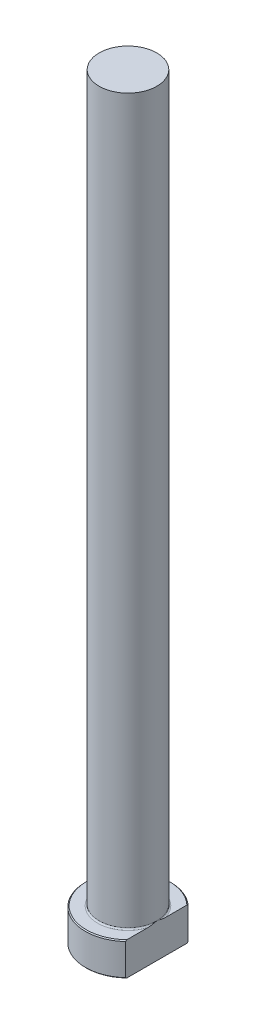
from build123d import *
from build123d.topology import SkipClean

# Parameters (mm, degrees)
CHAMFER1_SIZE = 0.2
FILLET1_R     = 0.3
KEY_DEPTH     = 161.505451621


with BuildPart() as part:
    # Sketch1 → Revolve1 (revolve)
    with BuildSketch(Plane.XY, mode=Mode.PRIVATE) as revolve1_sk:
        Polygon((0, 0), (-9, 0), (-9, 7), (-6.1, 7), (-6.1, 160), (0, 160), align=None)
    revolve(revolve1_sk.sketch.rotate(Axis((0, 259.958771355, 0), (0, -1, 0)), 270), axis=Axis((0, 259.958771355, 0), (0, -1, 0)))

    # Chamfer1
    chamfer1_edges = [part.edges().sort_by_distance(p)[0] for p in [
        (0, 7, -9),
        (0, 0, -9),
    ]]
    chamfer(chamfer1_edges, length=CHAMFER1_SIZE)

    # Fillet1
    fillet1_edges = [part.edges().sort_by_distance(p)[0] for p in [
        (0, 7, -6.1),
    ]]
    fillet(fillet1_edges, radius=FILLET1_R)

    # Sketch2 → KEY (cut, through all)
    with SkipClean():  # the faces are left unmerged after this step: merging them gives an invalid solid
        with BuildSketch(Plane(origin=(0, 0, 0), x_dir=(1, 0, 0), z_dir=(0, 1, 0))):
            with BuildLine():
                Line((6.1, 6.617401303), (6.1, -6.617401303))
                ThreePointArc((6.1, -6.617401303), (9, 0), (6.1, 6.617401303))
            make_face()
        extrude(amount=KEY_DEPTH, mode=Mode.SUBTRACT)


solid = part.part
